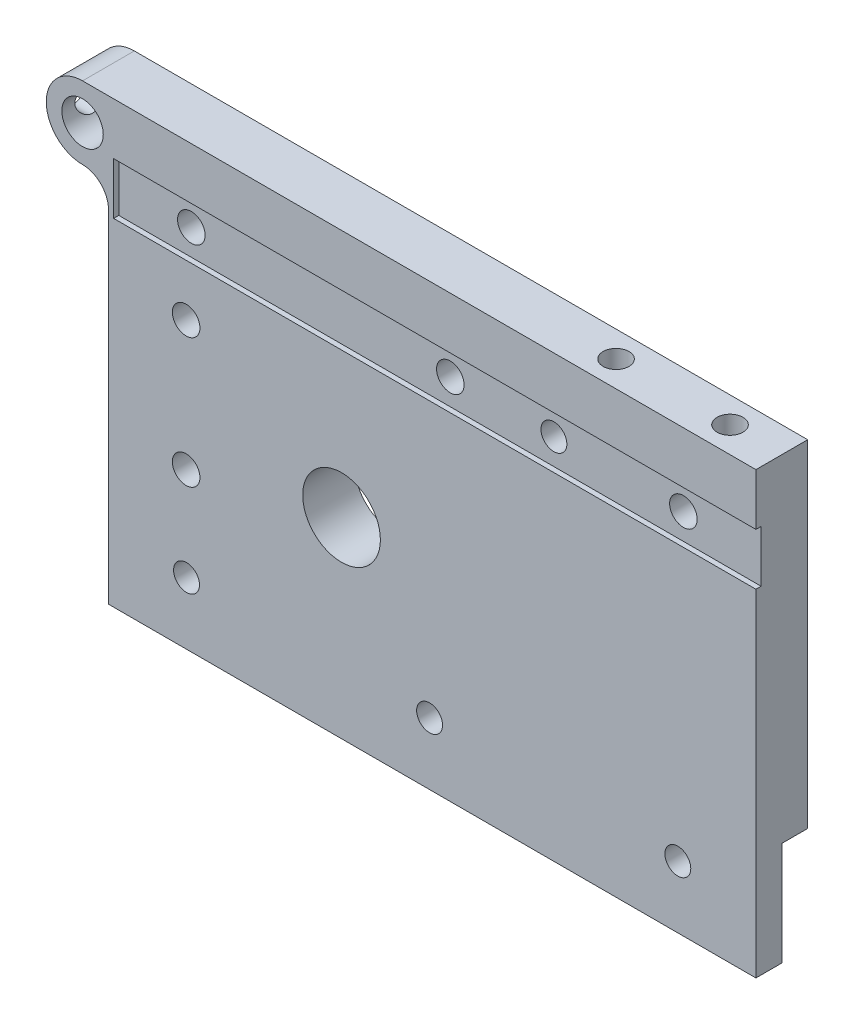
from build123d import *

# Parameters (mm, degrees)
SKETCH1_R                                         = 5.08
SKETCH1_R_2                                       = 9.525
SKETCH1_R_3                                       = 3.175
BOSS_EXTRUDE1_DEPTH                               = 6.35
SKETCH2_W                                         = 158.75
SKETCH2_H                                         = 25.4
CUT_EXTRUDE1_DEPTH                                = 12.7
SKETCH6_R                                         = 3.175
CUT_EXTRUDE2_DEPTH                                = 22.098
SKETCH8_R                                         = 3.175
CUT_EXTRUDE4_DEPTH                                = 12.7
SKETCH9_R                                         = 3.175
CUT_EXTRUDE5_DEPTH                                = 8.89
CBORE_FOR_1_4_PAN_HEAD_MACHINE_SCREW1_D           = 6.7564
CBORE_FOR_1_4_PAN_HEAD_MACHINE_SCREW1_CBORE_D     = 10.4648
CBORE_FOR_1_4_PAN_HEAD_MACHINE_SCREW1_CBORE_DEPTH = 6.35
SKETCH13_W                                        = 157.48
SKETCH13_H                                        = 12.7
CUT_EXTRUDE6_DEPTH                                = 1.27


with BuildPart() as part:
    # Sketch1 → Boss-Extrude1 (new, symmetric)
    with BuildSketch(Plane.XY):
        with BuildLine():
            Line((-85.725, 53.975), (79.375, 53.975))
            Line((79.375, 53.975), (79.375, -53.975))
            Line((79.375, -53.975), (-79.375, -53.975))
            Line((-79.375, -53.975), (-79.375, 29.845))
            ThreePointArc((-79.375, 29.845), (-81.234871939, 34.335128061), (-85.725, 36.195))
            ThreePointArc((-85.725, 36.195), (-94.615, 45.085), (-85.725, 53.975))
        make_face()
        with Locations((-85.725, 45.085)):
            Circle(SKETCH1_R, mode=Mode.SUBTRACT)
        with Locations((-22.225, -6.985)):
            Circle(SKETCH1_R_2, mode=Mode.SUBTRACT)
        with Locations((-60.228787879, -38.735)):
            Circle(SKETCH1_R_3, mode=Mode.SUBTRACT)
        with Locations((-0.635, -38.735)):
            Circle(SKETCH1_R_3, mode=Mode.SUBTRACT)
        with Locations((60.228787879, -38.735)):
            Circle(SKETCH1_R_3, mode=Mode.SUBTRACT)
    extrude(amount=BOSS_EXTRUDE1_DEPTH, both=True)

    # Sketch2 → Cut-Extrude1 (cut)
    with BuildSketch(Plane.XY):
        with Locations((0, -41.275)):
            Rectangle(SKETCH2_W, SKETCH2_H)
    extrude(amount=-CUT_EXTRUDE1_DEPTH, mode=Mode.SUBTRACT)

    # Sketch6 → Cut-Extrude2 (cut)
    with BuildSketch(Plane.XY.offset(6.35)):
        with Locations((28.575, 34.925)):
            Circle(SKETCH6_R)
    extrude(amount=-CUT_EXTRUDE2_DEPTH, mode=Mode.SUBTRACT)

    # Sketch8 → Cut-Extrude4 (cut)
    with BuildSketch(Plane(origin=(0, 53.975, 0), x_dir=(1, 0, 0), z_dir=(0, 1, 0))):
        with Locations(Location((66.675, 0, 0), (0, 0, 180))):
            Circle(SKETCH8_R)
        with Locations(Location((38.735, 0, 0), (0, 0, 180))):
            Circle(SKETCH8_R)
    extrude(amount=-CUT_EXTRUDE4_DEPTH, mode=Mode.SUBTRACT)

    # Sketch9 → Cut-Extrude5 (cut)
    with BuildSketch(Plane.ZY.offset(94.615)):
        with Locations((0, 45.085)):
            Circle(SKETCH9_R)
    extrude(amount=-CUT_EXTRUDE5_DEPTH, mode=Mode.SUBTRACT)

    # CBORE for 1_4 Pan Head Machine Screw1 (through all)
    with Locations(Plane(origin=(0, 0, -6.35), x_dir=(-1, 0, 0), z_dir=(0, 0, -1))):
        with Locations((-60.325, 34.925), (-3.175, 34.925), (60.325, 34.925), (60.325, 15.875), (60.325, -15.875)):
            CounterBoreHole(CBORE_FOR_1_4_PAN_HEAD_MACHINE_SCREW1_D / 2, CBORE_FOR_1_4_PAN_HEAD_MACHINE_SCREW1_CBORE_D / 2, CBORE_FOR_1_4_PAN_HEAD_MACHINE_SCREW1_CBORE_DEPTH)

    # Sketch13 → Cut-Extrude6 (cut)
    with BuildSketch(Plane.XY.offset(6.35)):
        with Locations((0.635, 34.925)):
            Rectangle(SKETCH13_W, SKETCH13_H)
    extrude(amount=-CUT_EXTRUDE6_DEPTH, mode=Mode.SUBTRACT)


solid = part.part
